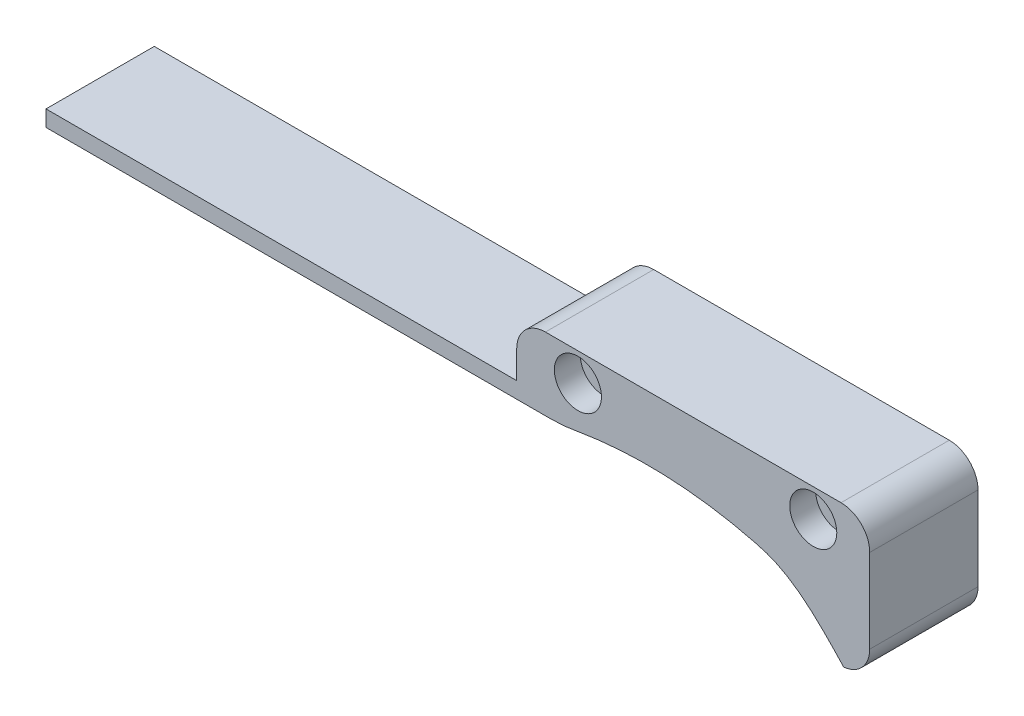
ISO-10303-21;
HEADER;
FILE_DESCRIPTION(('STEP AP214'),'2;1');
FILE_NAME('part.step','',(''),(''),'','','');
FILE_SCHEMA(('AUTOMOTIVE_DESIGN { 1 0 10303 214 1 1 1 1 }'));
ENDSEC;
DATA;
#1=APPLICATION_CONTEXT('core data for automotive mechanical design processes');
#2=APPLICATION_PROTOCOL_DEFINITION('international standard','automotive_design',2000,#1);
#3=PRODUCT_CONTEXT('',#1,'mechanical');
#4=PRODUCT('Part','Part','',(#3));
#5=PRODUCT_RELATED_PRODUCT_CATEGORY('part','',(#4));
#6=PRODUCT_DEFINITION_FORMATION('','',#4);
#7=PRODUCT_DEFINITION_CONTEXT('part definition',#1,'design');
#8=PRODUCT_DEFINITION('design','',#6,#7);
#9=PRODUCT_DEFINITION_SHAPE('','',#8);
#10=(LENGTH_UNIT() NAMED_UNIT(*) SI_UNIT(.MILLI.,.METRE.));
#11=(NAMED_UNIT(*) PLANE_ANGLE_UNIT() SI_UNIT($,.RADIAN.));
#12=(NAMED_UNIT(*) SI_UNIT($,.STERADIAN.) SOLID_ANGLE_UNIT());
#13=UNCERTAINTY_MEASURE_WITH_UNIT(LENGTH_MEASURE(1.E-05),#10,'distance_accuracy_value','');
#14=(GEOMETRIC_REPRESENTATION_CONTEXT(3) GLOBAL_UNCERTAINTY_ASSIGNED_CONTEXT((#13)) GLOBAL_UNIT_ASSIGNED_CONTEXT((#10,
#11,#12)) REPRESENTATION_CONTEXT('',''));
#15=CARTESIAN_POINT('',(0.,0.,0.));
#16=DIRECTION('',(0.,0.,1.));
#17=DIRECTION('',(1.,0.,0.));
#18=AXIS2_PLACEMENT_3D('',#15,#16,#17);
#19=CARTESIAN_POINT('',(13.,-6.,23.));
#20=DIRECTION('',(0.,0.,-1.));
#21=DIRECTION('',(-1.,0.,0.));
#22=AXIS2_PLACEMENT_3D('',#19,#20,#21);
#23=CYLINDRICAL_SURFACE('',#22,2.65);
#24=CARTESIAN_POINT('',(13.,-6.,5.5));
#25=DIRECTION('',(0.,0.,-1.));
#26=DIRECTION('',(-1.,0.,0.));
#27=AXIS2_PLACEMENT_3D('',#24,#25,#26);
#28=CIRCLE('',#27,2.65);
#29=CARTESIAN_POINT('',(10.35,-6.,5.5));
#30=VERTEX_POINT('',#29);
#31=EDGE_CURVE('E517',#30,#30,#28,.F.);
#32=ORIENTED_EDGE('',*,*,#31,.F.);
#33=EDGE_LOOP('',(#32));
#34=FACE_BOUND('',#33,.T.);
#35=CARTESIAN_POINT('',(13.,-6.,17.5));
#36=DIRECTION('',(0.,0.,1.));
#37=DIRECTION('',(1.,0.,0.));
#38=AXIS2_PLACEMENT_3D('',#35,#36,#37);
#39=CIRCLE('',#38,2.65);
#40=CARTESIAN_POINT('',(15.65,-6.,17.5));
#41=VERTEX_POINT('',#40);
#42=EDGE_CURVE('E522',#41,#41,#39,.F.);
#43=ORIENTED_EDGE('',*,*,#42,.F.);
#44=EDGE_LOOP('',(#43));
#45=FACE_BOUND('',#44,.T.);
#46=ADVANCED_FACE('F350',(#34,#45),#23,.F.);
#47=CARTESIAN_POINT('',(63.,-6.,23.));
#48=DIRECTION('',(0.,0.,-1.));
#49=DIRECTION('',(-1.,0.,0.));
#50=AXIS2_PLACEMENT_3D('',#47,#48,#49);
#51=CYLINDRICAL_SURFACE('',#50,2.65);
#52=CARTESIAN_POINT('',(63.,-6.,5.5));
#53=DIRECTION('',(0.,0.,-1.));
#54=DIRECTION('',(-1.,0.,0.));
#55=AXIS2_PLACEMENT_3D('',#52,#53,#54);
#56=CIRCLE('',#55,2.65);
#57=CARTESIAN_POINT('',(60.35,-6.,5.5));
#58=VERTEX_POINT('',#57);
#59=EDGE_CURVE('E456',#58,#58,#56,.F.);
#60=ORIENTED_EDGE('',*,*,#59,.F.);
#61=EDGE_LOOP('',(#60));
#62=FACE_BOUND('',#61,.T.);
#63=CARTESIAN_POINT('',(63.,-6.,17.5));
#64=DIRECTION('',(0.,0.,1.));
#65=DIRECTION('',(1.,0.,0.));
#66=AXIS2_PLACEMENT_3D('',#63,#64,#65);
#67=CIRCLE('',#66,2.65);
#68=CARTESIAN_POINT('',(65.65,-6.,17.5));
#69=VERTEX_POINT('',#68);
#70=EDGE_CURVE('E512',#69,#69,#67,.F.);
#71=ORIENTED_EDGE('',*,*,#70,.F.);
#72=EDGE_LOOP('',(#71));
#73=FACE_BOUND('',#72,.T.);
#74=ADVANCED_FACE('F556',(#62,#73),#51,.F.);
#75=CARTESIAN_POINT('',(0.,-15.,23.));
#76=CARTESIAN_POINT('',(4.09069045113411,-15.3596161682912,23.));
#77=CARTESIAN_POINT('',(8.25823005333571,-15.7259882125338,23.));
#78=CARTESIAN_POINT('',(12.6375231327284,-14.9144952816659,23.));
#79=CARTESIAN_POINT('',(13.3411541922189,-14.7989354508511,23.));
#80=CARTESIAN_POINT('',(14.2829936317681,-14.6454701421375,23.));
#81=CARTESIAN_POINT('',(15.2254352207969,-14.5080265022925,23.));
#82=CARTESIAN_POINT('',(16.1669212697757,-14.3770421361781,23.));
#83=CARTESIAN_POINT('',(17.1081046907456,-14.2587000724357,23.));
#84=CARTESIAN_POINT('',(18.0483697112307,-14.1489220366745,23.));
#85=CARTESIAN_POINT('',(18.9886017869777,-14.0520339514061,23.));
#86=CARTESIAN_POINT('',(19.9347157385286,-13.9606138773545,23.));
#87=CARTESIAN_POINT('',(20.874175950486,-13.8869671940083,23.));
#88=CARTESIAN_POINT('',(21.8125623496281,-13.8140737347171,23.));
#89=CARTESIAN_POINT('',(22.7440651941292,-13.7565750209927,23.));
#90=CARTESIAN_POINT('',(23.6761179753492,-13.7078551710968,23.));
#91=CARTESIAN_POINT('',(24.6134542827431,-13.6674909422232,23.));
#92=CARTESIAN_POINT('',(25.5505515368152,-13.6396821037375,23.));
#93=CARTESIAN_POINT('',(26.4932626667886,-13.6205533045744,23.));
#94=CARTESIAN_POINT('',(27.4296398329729,-13.6102072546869,23.));
#95=CARTESIAN_POINT('',(28.3656881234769,-13.610627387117,23.));
#96=CARTESIAN_POINT('',(29.3010741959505,-13.6192726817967,23.));
#97=CARTESIAN_POINT('',(30.2361310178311,-13.6382858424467,23.));
#98=CARTESIAN_POINT('',(31.1708246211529,-13.6675933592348,23.));
#99=CARTESIAN_POINT('',(32.105230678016,-13.7052929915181,23.));
#100=CARTESIAN_POINT('',(33.0389555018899,-13.7532673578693,23.));
#101=CARTESIAN_POINT('',(33.9726270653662,-13.8116214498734,23.));
#102=CARTESIAN_POINT('',(34.9056808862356,-13.8784563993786,23.));
#103=CARTESIAN_POINT('',(35.838760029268,-13.9544088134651,23.));
#104=CARTESIAN_POINT('',(36.7711644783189,-14.0402475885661,23.));
#105=CARTESIAN_POINT('',(37.7031346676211,-14.1366512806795,23.));
#106=CARTESIAN_POINT('',(38.6346107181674,-14.2411828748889,23.));
#107=CARTESIAN_POINT('',(39.5655107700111,-14.3569849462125,23.));
#108=CARTESIAN_POINT('',(40.4966077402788,-14.4792938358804,23.));
#109=CARTESIAN_POINT('',(41.4262279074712,-14.6181429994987,23.));
#110=CARTESIAN_POINT('',(42.3570189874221,-14.7565122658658,23.));
#111=CARTESIAN_POINT('',(43.2864842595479,-14.9105604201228,23.));
#112=CARTESIAN_POINT('',(44.2157713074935,-15.0737110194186,23.));
#113=CARTESIAN_POINT('',(45.1446160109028,-15.2453499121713,23.));
#114=CARTESIAN_POINT('',(46.0729748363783,-15.4275015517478,23.));
#115=CARTESIAN_POINT('',(47.0005835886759,-15.6196722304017,23.));
#116=CARTESIAN_POINT('',(47.9280671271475,-15.8205251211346,23.));
#117=CARTESIAN_POINT('',(48.8547995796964,-16.0314831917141,23.));
#118=CARTESIAN_POINT('',(49.781154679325,-16.2525729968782,23.));
#119=CARTESIAN_POINT('',(50.706862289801,-16.4837588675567,23.));
#120=CARTESIAN_POINT('',(51.3763059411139,-16.6572836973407,23.));
#121=CARTESIAN_POINT('',(58.8394068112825,-18.6684716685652,23.));
#122=CARTESIAN_POINT('',(64.1754759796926,-24.335735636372,23.));
#123=CARTESIAN_POINT('',(69.472,-29.961,23.));
#124=B_SPLINE_CURVE_WITH_KNOTS('',3,(#75,#76,#77,#78,#79,#80,#81,#82,#83,#84,#85,#86,#87,#88,
#89,#90,#91,#92,#93,#94,#95,#96,#97,#98,#99,#100,#101,#102,#103,#104,#105,#106,#107,#108,#109,
#110,#111,#112,#113,#114,#115,#116,#117,#118,#119,#120,#121,#122,#123),.UNSPECIFIED.,.F.,.F.,(4,
1,1,1,1,1,1,1,1,1,1,1,1,1,1,1,1,1,1,1,1,1,1,1,1,1,1,1,1,1,1,1,1,1,1,1,1,1,1,1,1,1,1,1,1,1,4),
(0.,0.164049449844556,0.167131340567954,0.180020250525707,0.192876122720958,0.205707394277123,
0.218521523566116,0.231302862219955,0.244054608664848,0.256790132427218,0.269513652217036,
0.282479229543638,0.294884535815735,0.307562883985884,0.320206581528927,0.332615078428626,
0.345490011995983,0.358105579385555,0.370732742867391,0.383345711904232,0.395945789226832,
0.408547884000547,0.421153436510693,0.433749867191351,0.446352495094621,0.458949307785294,
0.471567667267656,0.484168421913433,0.496794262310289,0.509419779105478,0.522044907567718,
0.534685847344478,0.547342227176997,0.560007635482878,0.57268296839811,0.585383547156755,
0.598093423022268,0.610824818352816,0.623568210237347,0.636338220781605,0.64912018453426,
0.661931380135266,0.674760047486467,0.687620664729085,0.700501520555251,0.702721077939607,1.),.UNSPECIFIED.);
#125=DIRECTION('',(0.,0.,-1.));
#126=VECTOR('',#125,1.);
#127=SURFACE_OF_LINEAR_EXTRUSION('',#124,#126);
#128=CARTESIAN_POINT('',(0.,-15.,0.));
#129=CARTESIAN_POINT('',(4.09069045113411,-15.3596161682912,0.));
#130=CARTESIAN_POINT('',(8.25823005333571,-15.7259882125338,0.));
#131=CARTESIAN_POINT('',(12.6375231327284,-14.9144952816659,0.));
#132=CARTESIAN_POINT('',(13.3411541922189,-14.7989354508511,0.));
#133=CARTESIAN_POINT('',(14.2829936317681,-14.6454701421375,0.));
#134=CARTESIAN_POINT('',(15.2254352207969,-14.5080265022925,0.));
#135=CARTESIAN_POINT('',(16.1669212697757,-14.3770421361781,0.));
#136=CARTESIAN_POINT('',(17.1081046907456,-14.2587000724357,0.));
#137=CARTESIAN_POINT('',(18.0483697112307,-14.1489220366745,0.));
#138=CARTESIAN_POINT('',(18.9886017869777,-14.0520339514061,0.));
#139=CARTESIAN_POINT('',(19.9347157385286,-13.9606138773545,0.));
#140=CARTESIAN_POINT('',(20.874175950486,-13.8869671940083,0.));
#141=CARTESIAN_POINT('',(21.8125623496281,-13.8140737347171,0.));
#142=CARTESIAN_POINT('',(22.7440651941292,-13.7565750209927,0.));
#143=CARTESIAN_POINT('',(23.6761179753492,-13.7078551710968,0.));
#144=CARTESIAN_POINT('',(24.6134542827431,-13.6674909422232,0.));
#145=CARTESIAN_POINT('',(25.5505515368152,-13.6396821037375,0.));
#146=CARTESIAN_POINT('',(26.4932626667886,-13.6205533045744,0.));
#147=CARTESIAN_POINT('',(27.4296398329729,-13.6102072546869,0.));
#148=CARTESIAN_POINT('',(28.3656881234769,-13.610627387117,0.));
#149=CARTESIAN_POINT('',(29.3010741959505,-13.6192726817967,0.));
#150=CARTESIAN_POINT('',(30.2361310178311,-13.6382858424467,0.));
#151=CARTESIAN_POINT('',(31.1708246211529,-13.6675933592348,0.));
#152=CARTESIAN_POINT('',(32.105230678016,-13.7052929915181,0.));
#153=CARTESIAN_POINT('',(33.0389555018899,-13.7532673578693,0.));
#154=CARTESIAN_POINT('',(33.9726270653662,-13.8116214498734,0.));
#155=CARTESIAN_POINT('',(34.9056808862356,-13.8784563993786,0.));
#156=CARTESIAN_POINT('',(35.838760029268,-13.9544088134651,0.));
#157=CARTESIAN_POINT('',(36.7711644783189,-14.0402475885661,0.));
#158=CARTESIAN_POINT('',(37.7031346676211,-14.1366512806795,0.));
#159=CARTESIAN_POINT('',(38.6346107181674,-14.2411828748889,0.));
#160=CARTESIAN_POINT('',(39.5655107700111,-14.3569849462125,0.));
#161=CARTESIAN_POINT('',(40.4966077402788,-14.4792938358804,0.));
#162=CARTESIAN_POINT('',(41.4262279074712,-14.6181429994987,0.));
#163=CARTESIAN_POINT('',(42.3570189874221,-14.7565122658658,0.));
#164=CARTESIAN_POINT('',(43.2864842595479,-14.9105604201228,0.));
#165=CARTESIAN_POINT('',(44.2157713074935,-15.0737110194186,0.));
#166=CARTESIAN_POINT('',(45.1446160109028,-15.2453499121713,0.));
#167=CARTESIAN_POINT('',(46.0729748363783,-15.4275015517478,0.));
#168=CARTESIAN_POINT('',(47.0005835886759,-15.6196722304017,0.));
#169=CARTESIAN_POINT('',(47.9280671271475,-15.8205251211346,0.));
#170=CARTESIAN_POINT('',(48.8547995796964,-16.0314831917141,0.));
#171=CARTESIAN_POINT('',(49.781154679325,-16.2525729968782,0.));
#172=CARTESIAN_POINT('',(50.706862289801,-16.4837588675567,0.));
#173=CARTESIAN_POINT('',(51.3763059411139,-16.6572836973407,0.));
#174=CARTESIAN_POINT('',(58.8394068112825,-18.6684716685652,0.));
#175=CARTESIAN_POINT('',(64.1754759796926,-24.335735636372,0.));
#176=CARTESIAN_POINT('',(69.472,-29.961,0.));
#177=B_SPLINE_CURVE_WITH_KNOTS('',3,(#128,#129,#130,#131,#132,#133,#134,#135,#136,#137,#138,
#139,#140,#141,#142,#143,#144,#145,#146,#147,#148,#149,#150,#151,#152,#153,#154,#155,#156,#157,
#158,#159,#160,#161,#162,#163,#164,#165,#166,#167,#168,#169,#170,#171,#172,#173,#174,#175,#176),
.UNSPECIFIED.,.F.,.F.,(4,1,1,1,1,1,1,1,1,1,1,1,1,1,1,1,1,1,1,1,1,1,1,1,1,1,1,1,1,1,1,1,1,1,1,1,
1,1,1,1,1,1,1,1,1,1,4),(0.,0.164049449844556,0.167131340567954,0.180020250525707,
0.192876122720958,0.205707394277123,0.218521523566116,0.231302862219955,0.244054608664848,
0.256790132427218,0.269513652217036,0.282479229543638,0.294884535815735,0.307562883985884,
0.320206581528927,0.332615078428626,0.345490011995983,0.358105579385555,0.370732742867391,
0.383345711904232,0.395945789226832,0.408547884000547,0.421153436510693,0.433749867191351,
0.446352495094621,0.458949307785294,0.471567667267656,0.484168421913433,0.496794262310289,
0.509419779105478,0.522044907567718,0.534685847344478,0.547342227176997,0.560007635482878,
0.57268296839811,0.585383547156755,0.598093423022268,0.610824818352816,0.623568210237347,
0.636338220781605,0.64912018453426,0.661931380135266,0.674760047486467,0.687620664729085,
0.700501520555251,0.702721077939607,1.),.UNSPECIFIED.);
#178=CARTESIAN_POINT('',(6.95389114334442,-15.4150902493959,0.));
#179=VERTEX_POINT('',#178);
#180=CARTESIAN_POINT('',(69.472,-29.961,0.));
#181=VERTEX_POINT('',#180);
#182=EDGE_CURVE('E437',#179,#181,#177,.T.);
#183=ORIENTED_EDGE('',*,*,#182,.T.);
#184=DIRECTION('',(0.,0.,-1.));
#185=VECTOR('',#184,1.);
#186=CARTESIAN_POINT('',(69.472,-29.961,23.));
#187=LINE('',#186,#185);
#188=CARTESIAN_POINT('',(69.472,-29.961,23.));
#189=VERTEX_POINT('',#188);
#190=EDGE_CURVE('E444',#189,#181,#187,.T.);
#191=ORIENTED_EDGE('',*,*,#190,.F.);
#192=CARTESIAN_POINT('',(6.95389114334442,-15.4150902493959,23.));
#193=VERTEX_POINT('',#192);
#194=EDGE_CURVE('E480',#193,#189,#124,.T.);
#195=ORIENTED_EDGE('',*,*,#194,.F.);
#196=DIRECTION('',(0.,0.,-1.));
#197=VECTOR('',#196,1.);
#198=CARTESIAN_POINT('',(6.95389114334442,-15.4150902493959,23.));
#199=LINE('',#198,#197);
#200=EDGE_CURVE('E455',#193,#179,#199,.T.);
#201=ORIENTED_EDGE('',*,*,#200,.T.);
#202=EDGE_LOOP('',(#183,#191,#195,#201));
#203=FACE_BOUND('',#202,.T.);
#204=ADVANCED_FACE('F352',(#203),#127,.F.);
#205=CARTESIAN_POINT('',(68.913304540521,-23.9,23.));
#206=DIRECTION('',(0.,0.,-1.));
#207=DIRECTION('',(-1.,0.,0.));
#208=AXIS2_PLACEMENT_3D('',#205,#206,#207);
#209=CYLINDRICAL_SURFACE('',#208,6.08669545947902);
#210=CARTESIAN_POINT('',(68.913304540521,-23.9,0.));
#211=DIRECTION('',(0.,0.,1.));
#212=DIRECTION('',(-1.,0.,0.));
#213=AXIS2_PLACEMENT_3D('',#210,#211,#212);
#214=CIRCLE('',#213,6.08669545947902);
#215=CARTESIAN_POINT('',(75.,-23.9,0.));
#216=VERTEX_POINT('',#215);
#217=EDGE_CURVE('E431',#181,#216,#214,.T.);
#218=ORIENTED_EDGE('',*,*,#217,.T.);
#219=DIRECTION('',(0.,0.,-1.));
#220=VECTOR('',#219,1.);
#221=CARTESIAN_POINT('',(75.,-23.9,23.));
#222=LINE('',#221,#220);
#223=CARTESIAN_POINT('',(75.,-23.9,23.));
#224=VERTEX_POINT('',#223);
#225=EDGE_CURVE('E451',#224,#216,#222,.T.);
#226=ORIENTED_EDGE('',*,*,#225,.F.);
#227=CARTESIAN_POINT('',(68.913304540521,-23.9,23.));
#228=DIRECTION('',(0.,0.,1.));
#229=DIRECTION('',(-1.,0.,0.));
#230=AXIS2_PLACEMENT_3D('',#227,#228,#229);
#231=CIRCLE('',#230,6.08669545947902);
#232=EDGE_CURVE('E446',#189,#224,#231,.T.);
#233=ORIENTED_EDGE('',*,*,#232,.F.);
#234=ORIENTED_EDGE('',*,*,#190,.T.);
#235=EDGE_LOOP('',(#218,#226,#233,#234));
#236=FACE_BOUND('',#235,.T.);
#237=ADVANCED_FACE('F445',(#236),#209,.T.);
#238=CARTESIAN_POINT('',(75.,0.,23.));
#239=DIRECTION('',(-1.,0.,0.));
#240=DIRECTION('',(0.,0.,1.));
#241=AXIS2_PLACEMENT_3D('',#238,#239,#240);
#242=PLANE('',#241);
#243=DIRECTION('',(0.,1.,0.));
#244=VECTOR('',#243,1.);
#245=CARTESIAN_POINT('',(75.,0.,0.));
#246=LINE('',#245,#244);
#247=CARTESIAN_POINT('',(75.,-6.1,0.));
#248=VERTEX_POINT('',#247);
#249=EDGE_CURVE('E438',#216,#248,#246,.T.);
#250=ORIENTED_EDGE('',*,*,#249,.T.);
#251=DIRECTION('',(0.,0.,-1.));
#252=VECTOR('',#251,1.);
#253=CARTESIAN_POINT('',(75.,-6.1,23.));
#254=LINE('',#253,#252);
#255=CARTESIAN_POINT('',(75.,-6.1,23.));
#256=VERTEX_POINT('',#255);
#257=EDGE_CURVE('E374',#248,#256,#254,.F.);
#258=ORIENTED_EDGE('',*,*,#257,.T.);
#259=DIRECTION('',(0.,1.,0.));
#260=VECTOR('',#259,1.);
#261=CARTESIAN_POINT('',(75.,0.,23.));
#262=LINE('',#261,#260);
#263=EDGE_CURVE('E489',#224,#256,#262,.T.);
#264=ORIENTED_EDGE('',*,*,#263,.F.);
#265=ORIENTED_EDGE('',*,*,#225,.T.);
#266=EDGE_LOOP('',(#250,#258,#264,#265));
#267=FACE_BOUND('',#266,.T.);
#268=ADVANCED_FACE('F545',(#267),#242,.F.);
#269=CARTESIAN_POINT('',(0.,0.,23.));
#270=DIRECTION('',(0.,-1.,0.));
#271=DIRECTION('',(0.,0.,-1.));
#272=AXIS2_PLACEMENT_3D('',#269,#270,#271);
#273=PLANE('',#272);
#274=DIRECTION('',(-1.,0.,0.));
#275=VECTOR('',#274,1.);
#276=CARTESIAN_POINT('',(0.,0.,23.));
#277=LINE('',#276,#275);
#278=CARTESIAN_POINT('',(68.9,0.,23.));
#279=VERTEX_POINT('',#278);
#280=CARTESIAN_POINT('',(6.1,0.,23.));
#281=VERTEX_POINT('',#280);
#282=EDGE_CURVE('E491',#279,#281,#277,.T.);
#283=ORIENTED_EDGE('',*,*,#282,.F.);
#284=DIRECTION('',(0.,0.,-1.));
#285=VECTOR('',#284,1.);
#286=CARTESIAN_POINT('',(68.9,0.,23.));
#287=LINE('',#286,#285);
#288=CARTESIAN_POINT('',(68.9,0.,0.));
#289=VERTEX_POINT('',#288);
#290=EDGE_CURVE('E528',#279,#289,#287,.T.);
#291=ORIENTED_EDGE('',*,*,#290,.T.);
#292=DIRECTION('',(-1.,0.,0.));
#293=VECTOR('',#292,1.);
#294=CARTESIAN_POINT('',(0.,0.,0.));
#295=LINE('',#294,#293);
#296=CARTESIAN_POINT('',(6.1,0.,0.));
#297=VERTEX_POINT('',#296);
#298=EDGE_CURVE('E470',#289,#297,#295,.T.);
#299=ORIENTED_EDGE('',*,*,#298,.T.);
#300=DIRECTION('',(0.,0.,-1.));
#301=VECTOR('',#300,1.);
#302=CARTESIAN_POINT('',(6.1,0.,23.));
#303=LINE('',#302,#301);
#304=EDGE_CURVE('E450',#297,#281,#303,.F.);
#305=ORIENTED_EDGE('',*,*,#304,.T.);
#306=EDGE_LOOP('',(#283,#291,#299,#305));
#307=FACE_BOUND('',#306,.T.);
#308=ADVANCED_FACE('F542',(#307),#273,.F.);
#309=CARTESIAN_POINT('',(0.,-11.9958564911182,23.));
#310=DIRECTION('',(1.,0.,0.));
#311=DIRECTION('',(0.,0.,-1.));
#312=AXIS2_PLACEMENT_3D('',#309,#310,#311);
#313=PLANE('',#312);
#314=DIRECTION('',(0.,-1.,0.));
#315=VECTOR('',#314,1.);
#316=CARTESIAN_POINT('',(0.,-11.9958564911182,23.));
#317=LINE('',#316,#315);
#318=CARTESIAN_POINT('',(0.,-6.1,23.));
#319=VERTEX_POINT('',#318);
#320=CARTESIAN_POINT('',(0.,-11.9958564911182,23.));
#321=VERTEX_POINT('',#320);
#322=EDGE_CURVE('E493',#319,#321,#317,.T.);
#323=ORIENTED_EDGE('',*,*,#322,.F.);
#324=DIRECTION('',(0.,0.,-1.));
#325=VECTOR('',#324,1.);
#326=CARTESIAN_POINT('',(0.,-6.1,23.));
#327=LINE('',#326,#325);
#328=CARTESIAN_POINT('',(0.,-6.1,0.));
#329=VERTEX_POINT('',#328);
#330=EDGE_CURVE('E11',#319,#329,#327,.T.);
#331=ORIENTED_EDGE('',*,*,#330,.T.);
#332=DIRECTION('',(0.,-1.,0.));
#333=VECTOR('',#332,1.);
#334=CARTESIAN_POINT('',(0.,-11.9958564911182,0.));
#335=LINE('',#334,#333);
#336=CARTESIAN_POINT('',(0.,-11.9958564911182,0.));
#337=VERTEX_POINT('',#336);
#338=EDGE_CURVE('E473',#329,#337,#335,.T.);
#339=ORIENTED_EDGE('',*,*,#338,.T.);
#340=DIRECTION('',(0.,0.,-1.));
#341=VECTOR('',#340,1.);
#342=CARTESIAN_POINT('',(0.,-11.9958564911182,23.));
#343=LINE('',#342,#341);
#344=EDGE_CURVE('E508',#321,#337,#343,.T.);
#345=ORIENTED_EDGE('',*,*,#344,.F.);
#346=EDGE_LOOP('',(#323,#331,#339,#345));
#347=FACE_BOUND('',#346,.T.);
#348=ADVANCED_FACE('F552',(#347),#313,.F.);
#349=CARTESIAN_POINT('',(-100.,-11.9958564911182,23.));
#350=DIRECTION('',(0.,-1.,0.));
#351=DIRECTION('',(0.,0.,-1.));
#352=AXIS2_PLACEMENT_3D('',#349,#350,#351);
#353=PLANE('',#352);
#354=DIRECTION('',(-1.,0.,0.));
#355=VECTOR('',#354,1.);
#356=CARTESIAN_POINT('',(-100.,-11.9958564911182,0.));
#357=LINE('',#356,#355);
#358=CARTESIAN_POINT('',(-100.,-11.9958564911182,0.));
#359=VERTEX_POINT('',#358);
#360=EDGE_CURVE('E475',#337,#359,#357,.T.);
#361=ORIENTED_EDGE('',*,*,#360,.T.);
#362=DIRECTION('',(0.,0.,-1.));
#363=VECTOR('',#362,1.);
#364=CARTESIAN_POINT('',(-100.,-11.9958564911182,23.));
#365=LINE('',#364,#363);
#366=CARTESIAN_POINT('',(-100.,-11.9958564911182,23.));
#367=VERTEX_POINT('',#366);
#368=EDGE_CURVE('E505',#367,#359,#365,.T.);
#369=ORIENTED_EDGE('',*,*,#368,.F.);
#370=DIRECTION('',(-1.,0.,0.));
#371=VECTOR('',#370,1.);
#372=CARTESIAN_POINT('',(-100.,-11.9958564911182,23.));
#373=LINE('',#372,#371);
#374=EDGE_CURVE('E495',#321,#367,#373,.T.);
#375=ORIENTED_EDGE('',*,*,#374,.F.);
#376=ORIENTED_EDGE('',*,*,#344,.T.);
#377=EDGE_LOOP('',(#361,#369,#375,#376));
#378=FACE_BOUND('',#377,.T.);
#379=ADVANCED_FACE('F601',(#378),#353,.F.);
#380=CARTESIAN_POINT('',(-100.,-15.4150902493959,23.));
#381=DIRECTION('',(1.,0.,0.));
#382=DIRECTION('',(0.,0.,-1.));
#383=AXIS2_PLACEMENT_3D('',#380,#381,#382);
#384=PLANE('',#383);
#385=DIRECTION('',(0.,-1.,0.));
#386=VECTOR('',#385,1.);
#387=CARTESIAN_POINT('',(-100.,-15.4150902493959,0.));
#388=LINE('',#387,#386);
#389=CARTESIAN_POINT('',(-100.,-15.4150902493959,0.));
#390=VERTEX_POINT('',#389);
#391=EDGE_CURVE('E477',#359,#390,#388,.T.);
#392=ORIENTED_EDGE('',*,*,#391,.T.);
#393=DIRECTION('',(0.,0.,-1.));
#394=VECTOR('',#393,1.);
#395=CARTESIAN_POINT('',(-100.,-15.4150902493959,23.));
#396=LINE('',#395,#394);
#397=CARTESIAN_POINT('',(-100.,-15.4150902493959,23.));
#398=VERTEX_POINT('',#397);
#399=EDGE_CURVE('E502',#398,#390,#396,.T.);
#400=ORIENTED_EDGE('',*,*,#399,.F.);
#401=DIRECTION('',(0.,-1.,0.));
#402=VECTOR('',#401,1.);
#403=CARTESIAN_POINT('',(-100.,-15.4150902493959,23.));
#404=LINE('',#403,#402);
#405=EDGE_CURVE('E497',#367,#398,#404,.T.);
#406=ORIENTED_EDGE('',*,*,#405,.F.);
#407=ORIENTED_EDGE('',*,*,#368,.T.);
#408=EDGE_LOOP('',(#392,#400,#406,#407));
#409=FACE_BOUND('',#408,.T.);
#410=ADVANCED_FACE('F597',(#409),#384,.F.);
#411=CARTESIAN_POINT('',(6.95389114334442,-15.4150902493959,23.));
#412=DIRECTION('',(0.,1.,0.));
#413=DIRECTION('',(-1.,0.,0.));
#414=AXIS2_PLACEMENT_3D('',#411,#412,#413);
#415=PLANE('',#414);
#416=DIRECTION('',(1.,0.,0.));
#417=VECTOR('',#416,1.);
#418=CARTESIAN_POINT('',(6.95389114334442,-15.4150902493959,0.));
#419=LINE('',#418,#417);
#420=EDGE_CURVE('E479',#390,#179,#419,.T.);
#421=ORIENTED_EDGE('',*,*,#420,.T.);
#422=ORIENTED_EDGE('',*,*,#200,.F.);
#423=DIRECTION('',(1.,0.,0.));
#424=VECTOR('',#423,1.);
#425=CARTESIAN_POINT('',(6.95389114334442,-15.4150902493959,23.));
#426=LINE('',#425,#424);
#427=EDGE_CURVE('E499',#398,#193,#426,.T.);
#428=ORIENTED_EDGE('',*,*,#427,.F.);
#429=ORIENTED_EDGE('',*,*,#399,.T.);
#430=EDGE_LOOP('',(#421,#422,#428,#429));
#431=FACE_BOUND('',#430,.T.);
#432=ADVANCED_FACE('F593',(#431),#415,.F.);
#433=CARTESIAN_POINT('',(37.0077348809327,-14.0654757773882,23.));
#434=DIRECTION('',(0.,0.,-1.));
#435=DIRECTION('',(-1.,0.,0.));
#436=AXIS2_PLACEMENT_3D('',#433,#434,#435);
#437=PLANE('',#436);
#438=CARTESIAN_POINT('',(13.,-6.,23.));
#439=DIRECTION('',(0.,0.,1.));
#440=DIRECTION('',(1.,0.,0.));
#441=AXIS2_PLACEMENT_3D('',#438,#439,#440);
#442=CIRCLE('',#441,5.);
#443=CARTESIAN_POINT('',(18.,-6.,23.));
#444=VERTEX_POINT('',#443);
#445=EDGE_CURVE('E668',#444,#444,#442,.T.);
#446=ORIENTED_EDGE('',*,*,#445,.F.);
#447=EDGE_LOOP('',(#446));
#448=FACE_BOUND('',#447,.T.);
#449=CARTESIAN_POINT('',(63.,-6.,23.));
#450=DIRECTION('',(0.,0.,1.));
#451=DIRECTION('',(1.,0.,0.));
#452=AXIS2_PLACEMENT_3D('',#449,#450,#451);
#453=CIRCLE('',#452,5.);
#454=CARTESIAN_POINT('',(68.,-6.,23.));
#455=VERTEX_POINT('',#454);
#456=EDGE_CURVE('E520',#455,#455,#453,.T.);
#457=ORIENTED_EDGE('',*,*,#456,.F.);
#458=EDGE_LOOP('',(#457));
#459=FACE_BOUND('',#458,.T.);
#460=ORIENTED_EDGE('',*,*,#263,.T.);
#461=CARTESIAN_POINT('',(68.9,-6.1,23.));
#462=DIRECTION('',(0.,0.,-1.));
#463=DIRECTION('',(-1.,0.,0.));
#464=AXIS2_PLACEMENT_3D('',#461,#462,#463);
#465=CIRCLE('',#464,6.1);
#466=EDGE_CURVE('E359',#256,#279,#465,.F.);
#467=ORIENTED_EDGE('',*,*,#466,.T.);
#468=ORIENTED_EDGE('',*,*,#282,.T.);
#469=CARTESIAN_POINT('',(6.1,-6.1,23.));
#470=DIRECTION('',(0.,0.,-1.));
#471=DIRECTION('',(-1.,0.,0.));
#472=AXIS2_PLACEMENT_3D('',#469,#470,#471);
#473=CIRCLE('',#472,6.1);
#474=EDGE_CURVE('E366',#281,#319,#473,.F.);
#475=ORIENTED_EDGE('',*,*,#474,.T.);
#476=ORIENTED_EDGE('',*,*,#322,.T.);
#477=ORIENTED_EDGE('',*,*,#374,.T.);
#478=ORIENTED_EDGE('',*,*,#405,.T.);
#479=ORIENTED_EDGE('',*,*,#427,.T.);
#480=ORIENTED_EDGE('',*,*,#194,.T.);
#481=ORIENTED_EDGE('',*,*,#232,.T.);
#482=EDGE_LOOP('',(#460,#467,#468,#475,#476,#477,#478,#479,#480,#481));
#483=FACE_BOUND('',#482,.T.);
#484=ADVANCED_FACE('F538',(#448,#459,#483),#437,.F.);
#485=CARTESIAN_POINT('',(37.0077348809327,-14.0654757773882,0.));
#486=DIRECTION('',(0.,0.,-1.));
#487=DIRECTION('',(-1.,0.,0.));
#488=AXIS2_PLACEMENT_3D('',#485,#486,#487);
#489=PLANE('',#488);
#490=CARTESIAN_POINT('',(12.9439890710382,-5.97264480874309,0.));
#491=DIRECTION('',(0.,0.,-1.));
#492=DIRECTION('',(-1.,0.,0.));
#493=AXIS2_PLACEMENT_3D('',#490,#491,#492);
#494=CIRCLE('',#493,5.);
#495=CARTESIAN_POINT('',(7.94398907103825,-5.97264480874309,0.));
#496=VERTEX_POINT('',#495);
#497=EDGE_CURVE('E525',#496,#496,#494,.T.);
#498=ORIENTED_EDGE('',*,*,#497,.F.);
#499=EDGE_LOOP('',(#498));
#500=FACE_BOUND('',#499,.T.);
#501=CARTESIAN_POINT('',(62.9439890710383,-5.97264480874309,0.));
#502=DIRECTION('',(0.,0.,-1.));
#503=DIRECTION('',(-1.,0.,0.));
#504=AXIS2_PLACEMENT_3D('',#501,#502,#503);
#505=CIRCLE('',#504,5.);
#506=CARTESIAN_POINT('',(57.9439890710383,-5.97264480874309,0.));
#507=VERTEX_POINT('',#506);
#508=EDGE_CURVE('E515',#507,#507,#505,.T.);
#509=ORIENTED_EDGE('',*,*,#508,.F.);
#510=EDGE_LOOP('',(#509));
#511=FACE_BOUND('',#510,.T.);
#512=ORIENTED_EDGE('',*,*,#298,.F.);
#513=CARTESIAN_POINT('',(68.9,-6.1,0.));
#514=DIRECTION('',(0.,0.,-1.));
#515=DIRECTION('',(-1.,0.,0.));
#516=AXIS2_PLACEMENT_3D('',#513,#514,#515);
#517=CIRCLE('',#516,6.1);
#518=EDGE_CURVE('E533',#289,#248,#517,.T.);
#519=ORIENTED_EDGE('',*,*,#518,.T.);
#520=ORIENTED_EDGE('',*,*,#249,.F.);
#521=ORIENTED_EDGE('',*,*,#217,.F.);
#522=ORIENTED_EDGE('',*,*,#182,.F.);
#523=ORIENTED_EDGE('',*,*,#420,.F.);
#524=ORIENTED_EDGE('',*,*,#391,.F.);
#525=ORIENTED_EDGE('',*,*,#360,.F.);
#526=ORIENTED_EDGE('',*,*,#338,.F.);
#527=CARTESIAN_POINT('',(6.1,-6.1,0.));
#528=DIRECTION('',(0.,0.,-1.));
#529=DIRECTION('',(-1.,0.,0.));
#530=AXIS2_PLACEMENT_3D('',#527,#528,#529);
#531=CIRCLE('',#530,6.1);
#532=EDGE_CURVE('E531',#329,#297,#531,.T.);
#533=ORIENTED_EDGE('',*,*,#532,.T.);
#534=EDGE_LOOP('',(#512,#519,#520,#521,#522,#523,#524,#525,#526,#533));
#535=FACE_BOUND('',#534,.T.);
#536=ADVANCED_FACE('F434',(#500,#511,#535),#489,.T.);
#537=CARTESIAN_POINT('',(62.9439890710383,-5.97264480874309,5.5));
#538=DIRECTION('',(0.,0.,-1.));
#539=DIRECTION('',(-1.,0.,0.));
#540=AXIS2_PLACEMENT_3D('',#537,#538,#539);
#541=PLANE('',#540);
#542=CARTESIAN_POINT('',(62.9439890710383,-5.97264480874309,5.5));
#543=DIRECTION('',(0.,0.,-1.));
#544=DIRECTION('',(-1.,0.,0.));
#545=AXIS2_PLACEMENT_3D('',#542,#543,#544);
#546=CIRCLE('',#545,5.);
#547=CARTESIAN_POINT('',(57.9439890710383,-5.97264480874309,5.5));
#548=VERTEX_POINT('',#547);
#549=EDGE_CURVE('E459',#548,#548,#546,.T.);
#550=ORIENTED_EDGE('',*,*,#549,.T.);
#551=EDGE_LOOP('',(#550));
#552=FACE_BOUND('',#551,.T.);
#553=ORIENTED_EDGE('',*,*,#59,.T.);
#554=EDGE_LOOP('',(#553));
#555=FACE_BOUND('',#554,.T.);
#556=ADVANCED_FACE('F581',(#552,#555),#541,.T.);
#557=CARTESIAN_POINT('',(62.9439890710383,-5.97264480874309,5.5));
#558=DIRECTION('',(0.,0.,-1.));
#559=DIRECTION('',(-1.,0.,0.));
#560=AXIS2_PLACEMENT_3D('',#557,#558,#559);
#561=CYLINDRICAL_SURFACE('',#560,5.);
#562=ORIENTED_EDGE('',*,*,#549,.F.);
#563=EDGE_LOOP('',(#562));
#564=FACE_BOUND('',#563,.T.);
#565=ORIENTED_EDGE('',*,*,#508,.T.);
#566=EDGE_LOOP('',(#565));
#567=FACE_BOUND('',#566,.T.);
#568=ADVANCED_FACE('F576',(#564,#567),#561,.F.);
#569=CARTESIAN_POINT('',(63.,-6.,17.5));
#570=DIRECTION('',(0.,0.,1.));
#571=DIRECTION('',(1.,0.,0.));
#572=AXIS2_PLACEMENT_3D('',#569,#570,#571);
#573=PLANE('',#572);
#574=CARTESIAN_POINT('',(63.,-6.,17.5));
#575=DIRECTION('',(0.,0.,1.));
#576=DIRECTION('',(1.,0.,0.));
#577=AXIS2_PLACEMENT_3D('',#574,#575,#576);
#578=CIRCLE('',#577,5.);
#579=CARTESIAN_POINT('',(68.,-6.,17.5));
#580=VERTEX_POINT('',#579);
#581=EDGE_CURVE('E516',#580,#580,#578,.T.);
#582=ORIENTED_EDGE('',*,*,#581,.T.);
#583=EDGE_LOOP('',(#582));
#584=FACE_BOUND('',#583,.T.);
#585=ORIENTED_EDGE('',*,*,#70,.T.);
#586=EDGE_LOOP('',(#585));
#587=FACE_BOUND('',#586,.T.);
#588=ADVANCED_FACE('F572',(#584,#587),#573,.T.);
#589=CARTESIAN_POINT('',(63.,-6.,17.5));
#590=DIRECTION('',(0.,0.,1.));
#591=DIRECTION('',(1.,0.,0.));
#592=AXIS2_PLACEMENT_3D('',#589,#590,#591);
#593=CYLINDRICAL_SURFACE('',#592,5.);
#594=ORIENTED_EDGE('',*,*,#581,.F.);
#595=EDGE_LOOP('',(#594));
#596=FACE_BOUND('',#595,.T.);
#597=ORIENTED_EDGE('',*,*,#456,.T.);
#598=EDGE_LOOP('',(#597));
#599=FACE_BOUND('',#598,.T.);
#600=ADVANCED_FACE('F575',(#596,#599),#593,.F.);
#601=CARTESIAN_POINT('',(12.9439890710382,-5.97264480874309,5.5));
#602=DIRECTION('',(0.,0.,-1.));
#603=DIRECTION('',(-1.,0.,0.));
#604=AXIS2_PLACEMENT_3D('',#601,#602,#603);
#605=PLANE('',#604);
#606=CARTESIAN_POINT('',(12.9439890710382,-5.97264480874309,5.5));
#607=DIRECTION('',(0.,0.,-1.));
#608=DIRECTION('',(-1.,0.,0.));
#609=AXIS2_PLACEMENT_3D('',#606,#607,#608);
#610=CIRCLE('',#609,5.);
#611=CARTESIAN_POINT('',(7.94398907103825,-5.97264480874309,5.5));
#612=VERTEX_POINT('',#611);
#613=EDGE_CURVE('E521',#612,#612,#610,.T.);
#614=ORIENTED_EDGE('',*,*,#613,.T.);
#615=EDGE_LOOP('',(#614));
#616=FACE_BOUND('',#615,.T.);
#617=ORIENTED_EDGE('',*,*,#31,.T.);
#618=EDGE_LOOP('',(#617));
#619=FACE_BOUND('',#618,.T.);
#620=ADVANCED_FACE('F579',(#616,#619),#605,.T.);
#621=CARTESIAN_POINT('',(12.9439890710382,-5.97264480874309,5.5));
#622=DIRECTION('',(0.,0.,-1.));
#623=DIRECTION('',(-1.,0.,0.));
#624=AXIS2_PLACEMENT_3D('',#621,#622,#623);
#625=CYLINDRICAL_SURFACE('',#624,5.);
#626=ORIENTED_EDGE('',*,*,#613,.F.);
#627=EDGE_LOOP('',(#626));
#628=FACE_BOUND('',#627,.T.);
#629=ORIENTED_EDGE('',*,*,#497,.T.);
#630=EDGE_LOOP('',(#629));
#631=FACE_BOUND('',#630,.T.);
#632=ADVANCED_FACE('F570',(#628,#631),#625,.F.);
#633=CARTESIAN_POINT('',(13.,-6.,17.5));
#634=DIRECTION('',(0.,0.,1.));
#635=DIRECTION('',(1.,0.,0.));
#636=AXIS2_PLACEMENT_3D('',#633,#634,#635);
#637=PLANE('',#636);
#638=CARTESIAN_POINT('',(13.,-6.,17.5));
#639=DIRECTION('',(0.,0.,1.));
#640=DIRECTION('',(1.,0.,0.));
#641=AXIS2_PLACEMENT_3D('',#638,#639,#640);
#642=CIRCLE('',#641,5.);
#643=CARTESIAN_POINT('',(18.,-6.,17.5));
#644=VERTEX_POINT('',#643);
#645=EDGE_CURVE('E526',#644,#644,#642,.T.);
#646=ORIENTED_EDGE('',*,*,#645,.T.);
#647=EDGE_LOOP('',(#646));
#648=FACE_BOUND('',#647,.T.);
#649=ORIENTED_EDGE('',*,*,#42,.T.);
#650=EDGE_LOOP('',(#649));
#651=FACE_BOUND('',#650,.T.);
#652=ADVANCED_FACE('F630',(#648,#651),#637,.T.);
#653=CARTESIAN_POINT('',(13.,-6.,17.5));
#654=DIRECTION('',(0.,0.,1.));
#655=DIRECTION('',(1.,0.,0.));
#656=AXIS2_PLACEMENT_3D('',#653,#654,#655);
#657=CYLINDRICAL_SURFACE('',#656,5.);
#658=ORIENTED_EDGE('',*,*,#645,.F.);
#659=EDGE_LOOP('',(#658));
#660=FACE_BOUND('',#659,.T.);
#661=ORIENTED_EDGE('',*,*,#445,.T.);
#662=EDGE_LOOP('',(#661));
#663=FACE_BOUND('',#662,.T.);
#664=ADVANCED_FACE('F627',(#660,#663),#657,.F.);
#665=CARTESIAN_POINT('',(68.9,-6.1,23.));
#666=DIRECTION('',(0.,0.,-1.));
#667=DIRECTION('',(-1.,0.,0.));
#668=AXIS2_PLACEMENT_3D('',#665,#666,#667);
#669=CYLINDRICAL_SURFACE('',#668,6.1);
#670=ORIENTED_EDGE('',*,*,#466,.F.);
#671=ORIENTED_EDGE('',*,*,#257,.F.);
#672=ORIENTED_EDGE('',*,*,#518,.F.);
#673=ORIENTED_EDGE('',*,*,#290,.F.);
#674=EDGE_LOOP('',(#670,#671,#672,#673));
#675=FACE_BOUND('',#674,.T.);
#676=ADVANCED_FACE('F544',(#675),#669,.T.);
#677=CARTESIAN_POINT('',(6.1,-6.1,23.));
#678=DIRECTION('',(0.,0.,-1.));
#679=DIRECTION('',(-1.,0.,0.));
#680=AXIS2_PLACEMENT_3D('',#677,#678,#679);
#681=CYLINDRICAL_SURFACE('',#680,6.1);
#682=ORIENTED_EDGE('',*,*,#474,.F.);
#683=ORIENTED_EDGE('',*,*,#304,.F.);
#684=ORIENTED_EDGE('',*,*,#532,.F.);
#685=ORIENTED_EDGE('',*,*,#330,.F.);
#686=EDGE_LOOP('',(#682,#683,#684,#685));
#687=FACE_BOUND('',#686,.T.);
#688=ADVANCED_FACE('F615',(#687),#681,.T.);
#689=CLOSED_SHELL('',(#46,#74,#204,#237,#268,#308,#348,#379,#410,#432,#484,#536,#556,#568,#588,
#600,#620,#632,#652,#664,#676,#688));
#690=MANIFOLD_SOLID_BREP('B2',#689);
#691=ADVANCED_BREP_SHAPE_REPRESENTATION('',(#18,#690),#14);
#692=SHAPE_DEFINITION_REPRESENTATION(#9,#691);
ENDSEC;
END-ISO-10303-21;
